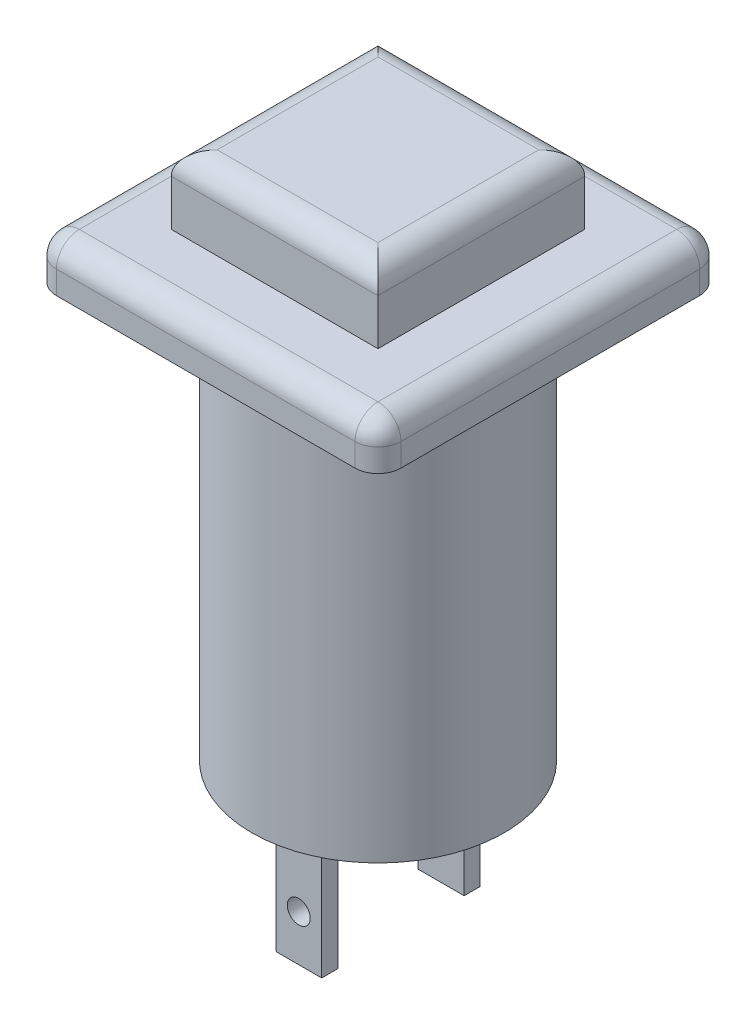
ISO-10303-21;
HEADER;
FILE_DESCRIPTION(('STEP AP214'),'2;1');
FILE_NAME('part.step','',(''),(''),'','','');
FILE_SCHEMA(('AUTOMOTIVE_DESIGN { 1 0 10303 214 1 1 1 1 }'));
ENDSEC;
DATA;
#1=APPLICATION_CONTEXT('core data for automotive mechanical design processes');
#2=APPLICATION_PROTOCOL_DEFINITION('international standard','automotive_design',2000,#1);
#3=PRODUCT_CONTEXT('',#1,'mechanical');
#4=PRODUCT('Part','Part','',(#3));
#5=PRODUCT_RELATED_PRODUCT_CATEGORY('part','',(#4));
#6=PRODUCT_DEFINITION_FORMATION('','',#4);
#7=PRODUCT_DEFINITION_CONTEXT('part definition',#1,'design');
#8=PRODUCT_DEFINITION('design','',#6,#7);
#9=PRODUCT_DEFINITION_SHAPE('','',#8);
#10=(LENGTH_UNIT() NAMED_UNIT(*) SI_UNIT(.MILLI.,.METRE.));
#11=(NAMED_UNIT(*) PLANE_ANGLE_UNIT() SI_UNIT($,.RADIAN.));
#12=(NAMED_UNIT(*) SI_UNIT($,.STERADIAN.) SOLID_ANGLE_UNIT());
#13=UNCERTAINTY_MEASURE_WITH_UNIT(LENGTH_MEASURE(1.E-05),#10,'distance_accuracy_value','');
#14=(GEOMETRIC_REPRESENTATION_CONTEXT(3) GLOBAL_UNCERTAINTY_ASSIGNED_CONTEXT((#13)) GLOBAL_UNIT_ASSIGNED_CONTEXT((#10,
#11,#12)) REPRESENTATION_CONTEXT('',''));
#15=CARTESIAN_POINT('',(0.,0.,0.));
#16=DIRECTION('',(0.,0.,1.));
#17=DIRECTION('',(1.,0.,0.));
#18=AXIS2_PLACEMENT_3D('',#15,#16,#17);
#19=CARTESIAN_POINT('',(-24.6836870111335,-42.0590909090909,0.));
#20=DIRECTION('',(0.,-1.,0.));
#21=DIRECTION('',(0.,0.,-1.));
#22=AXIS2_PLACEMENT_3D('',#19,#20,#21);
#23=PLANE('',#22);
#24=DIRECTION('',(1.,0.,0.));
#25=VECTOR('',#24,1.);
#26=CARTESIAN_POINT('',(-20.1836870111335,-42.0590909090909,2.75));
#27=LINE('',#26,#25);
#28=CARTESIAN_POINT('',(-20.1836870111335,-42.0590909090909,2.75));
#29=VERTEX_POINT('',#28);
#30=CARTESIAN_POINT('',(-18.1836870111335,-42.0590909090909,2.75));
#31=VERTEX_POINT('',#30);
#32=EDGE_CURVE('E239',#29,#31,#27,.T.);
#33=ORIENTED_EDGE('',*,*,#32,.F.);
#34=DIRECTION('',(0.,0.,-1.));
#35=VECTOR('',#34,1.);
#36=CARTESIAN_POINT('',(-20.1836870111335,-42.0590909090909,3.45));
#37=LINE('',#36,#35);
#38=CARTESIAN_POINT('',(-20.1836870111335,-42.0590909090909,3.45));
#39=VERTEX_POINT('',#38);
#40=EDGE_CURVE('E206',#39,#29,#37,.T.);
#41=ORIENTED_EDGE('',*,*,#40,.F.);
#42=DIRECTION('',(-1.,0.,0.));
#43=VECTOR('',#42,1.);
#44=CARTESIAN_POINT('',(-20.1836870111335,-42.0590909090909,3.45));
#45=LINE('',#44,#43);
#46=CARTESIAN_POINT('',(-18.1836870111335,-42.0590909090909,3.45));
#47=VERTEX_POINT('',#46);
#48=EDGE_CURVE('E243',#47,#39,#45,.T.);
#49=ORIENTED_EDGE('',*,*,#48,.F.);
#50=DIRECTION('',(0.,0.,1.));
#51=VECTOR('',#50,1.);
#52=CARTESIAN_POINT('',(-18.1836870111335,-42.0590909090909,3.45));
#53=LINE('',#52,#51);
#54=EDGE_CURVE('E241',#31,#47,#53,.T.);
#55=ORIENTED_EDGE('',*,*,#54,.F.);
#56=EDGE_LOOP('',(#33,#41,#49,#55));
#57=FACE_BOUND('',#56,.T.);
#58=CARTESIAN_POINT('',(-19.1836870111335,-42.0590909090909,0.));
#59=DIRECTION('',(0.,1.,0.));
#60=DIRECTION('',(0.,0.,1.));
#61=AXIS2_PLACEMENT_3D('',#58,#59,#60);
#62=CIRCLE('',#61,5.5);
#63=CARTESIAN_POINT('',(-19.1836870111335,-42.0590909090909,5.5));
#64=VERTEX_POINT('',#63);
#65=EDGE_CURVE('E323',#64,#64,#62,.T.);
#66=ORIENTED_EDGE('',*,*,#65,.F.);
#67=EDGE_LOOP('',(#66));
#68=FACE_BOUND('',#67,.T.);
#69=DIRECTION('',(1.,0.,0.));
#70=VECTOR('',#69,1.);
#71=CARTESIAN_POINT('',(-20.1836870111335,-42.0590909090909,-3.45));
#72=LINE('',#71,#70);
#73=CARTESIAN_POINT('',(-20.1836870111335,-42.0590909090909,-3.45));
#74=VERTEX_POINT('',#73);
#75=CARTESIAN_POINT('',(-18.1836870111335,-42.0590909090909,-3.45));
#76=VERTEX_POINT('',#75);
#77=EDGE_CURVE('E200',#74,#76,#72,.T.);
#78=ORIENTED_EDGE('',*,*,#77,.F.);
#79=DIRECTION('',(0.,0.,-1.));
#80=VECTOR('',#79,1.);
#81=CARTESIAN_POINT('',(-20.1836870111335,-42.0590909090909,-2.75));
#82=LINE('',#81,#80);
#83=CARTESIAN_POINT('',(-20.1836870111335,-42.0590909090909,-2.75));
#84=VERTEX_POINT('',#83);
#85=EDGE_CURVE('E211',#84,#74,#82,.T.);
#86=ORIENTED_EDGE('',*,*,#85,.F.);
#87=DIRECTION('',(-1.,0.,0.));
#88=VECTOR('',#87,1.);
#89=CARTESIAN_POINT('',(-20.1836870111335,-42.0590909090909,-2.75));
#90=LINE('',#89,#88);
#91=CARTESIAN_POINT('',(-18.1836870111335,-42.0590909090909,-2.75));
#92=VERTEX_POINT('',#91);
#93=EDGE_CURVE('E222',#92,#84,#90,.T.);
#94=ORIENTED_EDGE('',*,*,#93,.F.);
#95=DIRECTION('',(0.,0.,1.));
#96=VECTOR('',#95,1.);
#97=CARTESIAN_POINT('',(-18.1836870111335,-42.0590909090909,-2.75));
#98=LINE('',#97,#96);
#99=EDGE_CURVE('E220',#76,#92,#98,.T.);
#100=ORIENTED_EDGE('',*,*,#99,.F.);
#101=EDGE_LOOP('',(#78,#86,#94,#100));
#102=FACE_BOUND('',#101,.T.);
#103=ADVANCED_FACE('F33',(#57,#68,#102),#23,.T.);
#104=CARTESIAN_POINT('',(-26.1836870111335,-22.0590909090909,0.));
#105=DIRECTION('',(0.,1.,0.));
#106=DIRECTION('',(0.,0.,1.));
#107=AXIS2_PLACEMENT_3D('',#104,#105,#106);
#108=PLANE('',#107);
#109=DIRECTION('',(-1.,0.,0.));
#110=VECTOR('',#109,1.);
#111=CARTESIAN_POINT('',(-26.1836870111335,-22.0590909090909,-6.5));
#112=LINE('',#111,#110);
#113=CARTESIAN_POINT('',(-12.6836870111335,-22.0590909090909,-6.5));
#114=VERTEX_POINT('',#113);
#115=CARTESIAN_POINT('',(-25.6836870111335,-22.0590909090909,-6.5));
#116=VERTEX_POINT('',#115);
#117=EDGE_CURVE('E398',#114,#116,#112,.T.);
#118=ORIENTED_EDGE('',*,*,#117,.T.);
#119=DIRECTION('',(0.,0.,1.));
#120=VECTOR('',#119,1.);
#121=CARTESIAN_POINT('',(-25.6836870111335,-22.0590909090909,0.));
#122=LINE('',#121,#120);
#123=CARTESIAN_POINT('',(-25.6836870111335,-22.0590909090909,6.5));
#124=VERTEX_POINT('',#123);
#125=EDGE_CURVE('E400',#116,#124,#122,.T.);
#126=ORIENTED_EDGE('',*,*,#125,.T.);
#127=DIRECTION('',(1.,0.,0.));
#128=VECTOR('',#127,1.);
#129=CARTESIAN_POINT('',(-26.1836870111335,-22.0590909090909,6.5));
#130=LINE('',#129,#128);
#131=CARTESIAN_POINT('',(-12.6836870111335,-22.0590909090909,6.5));
#132=VERTEX_POINT('',#131);
#133=EDGE_CURVE('E394',#124,#132,#130,.T.);
#134=ORIENTED_EDGE('',*,*,#133,.T.);
#135=DIRECTION('',(0.,0.,-1.));
#136=VECTOR('',#135,1.);
#137=CARTESIAN_POINT('',(-12.6836870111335,-22.0590909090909,0.));
#138=LINE('',#137,#136);
#139=EDGE_CURVE('E396',#132,#114,#138,.T.);
#140=ORIENTED_EDGE('',*,*,#139,.T.);
#141=EDGE_LOOP('',(#118,#126,#134,#140));
#142=FACE_BOUND('',#141,.T.);
#143=DIRECTION('',(1.,0.,0.));
#144=VECTOR('',#143,1.);
#145=CARTESIAN_POINT('',(-14.6836870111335,-22.0590909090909,4.5));
#146=LINE('',#145,#144);
#147=CARTESIAN_POINT('',(-23.6836870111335,-22.0590909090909,4.5));
#148=VERTEX_POINT('',#147);
#149=CARTESIAN_POINT('',(-14.6836870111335,-22.0590909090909,4.5));
#150=VERTEX_POINT('',#149);
#151=EDGE_CURVE('E316',#148,#150,#146,.T.);
#152=ORIENTED_EDGE('',*,*,#151,.F.);
#153=DIRECTION('',(0.,0.,1.));
#154=VECTOR('',#153,1.);
#155=CARTESIAN_POINT('',(-23.6836870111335,-22.0590909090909,4.5));
#156=LINE('',#155,#154);
#157=CARTESIAN_POINT('',(-23.6836870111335,-22.0590909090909,-4.5));
#158=VERTEX_POINT('',#157);
#159=EDGE_CURVE('E313',#158,#148,#156,.T.);
#160=ORIENTED_EDGE('',*,*,#159,.F.);
#161=DIRECTION('',(-1.,0.,0.));
#162=VECTOR('',#161,1.);
#163=CARTESIAN_POINT('',(-14.6836870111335,-22.0590909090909,-4.5));
#164=LINE('',#163,#162);
#165=CARTESIAN_POINT('',(-14.6836870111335,-22.0590909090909,-4.5));
#166=VERTEX_POINT('',#165);
#167=EDGE_CURVE('E310',#166,#158,#164,.T.);
#168=ORIENTED_EDGE('',*,*,#167,.F.);
#169=DIRECTION('',(0.,0.,-1.));
#170=VECTOR('',#169,1.);
#171=CARTESIAN_POINT('',(-14.6836870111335,-22.0590909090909,4.5));
#172=LINE('',#171,#170);
#173=EDGE_CURVE('E307',#150,#166,#172,.T.);
#174=ORIENTED_EDGE('',*,*,#173,.F.);
#175=EDGE_LOOP('',(#152,#160,#168,#174));
#176=FACE_BOUND('',#175,.T.);
#177=ADVANCED_FACE('F428',(#142,#176),#108,.T.);
#178=CARTESIAN_POINT('',(-14.6836870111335,-22.0590909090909,4.5));
#179=DIRECTION('',(1.,0.,0.));
#180=DIRECTION('',(0.,0.,-1.));
#181=AXIS2_PLACEMENT_3D('',#178,#179,#180);
#182=PLANE('',#181);
#183=DIRECTION('',(0.,1.,0.));
#184=VECTOR('',#183,1.);
#185=CARTESIAN_POINT('',(-14.6836870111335,-22.0590909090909,-4.5));
#186=LINE('',#185,#184);
#187=CARTESIAN_POINT('',(-14.6836870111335,-20.0590909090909,-4.5));
#188=VERTEX_POINT('',#187);
#189=EDGE_CURVE('E319',#166,#188,#186,.T.);
#190=ORIENTED_EDGE('',*,*,#189,.T.);
#191=DIRECTION('',(0.,0.,-1.));
#192=VECTOR('',#191,1.);
#193=CARTESIAN_POINT('',(-14.6836870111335,-20.0590909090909,4.5));
#194=LINE('',#193,#192);
#195=CARTESIAN_POINT('',(-14.6836870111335,-20.0590909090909,4.5));
#196=VERTEX_POINT('',#195);
#197=EDGE_CURVE('E351',#188,#196,#194,.F.);
#198=ORIENTED_EDGE('',*,*,#197,.T.);
#199=DIRECTION('',(0.,1.,0.));
#200=VECTOR('',#199,1.);
#201=CARTESIAN_POINT('',(-14.6836870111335,-22.0590909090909,4.5));
#202=LINE('',#201,#200);
#203=EDGE_CURVE('E320',#150,#196,#202,.T.);
#204=ORIENTED_EDGE('',*,*,#203,.F.);
#205=ORIENTED_EDGE('',*,*,#173,.T.);
#206=EDGE_LOOP('',(#190,#198,#204,#205));
#207=FACE_BOUND('',#206,.T.);
#208=ADVANCED_FACE('F490',(#207),#182,.T.);
#209=CARTESIAN_POINT('',(-14.6836870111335,-22.0590909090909,4.5));
#210=DIRECTION('',(0.,0.,1.));
#211=DIRECTION('',(1.,0.,0.));
#212=AXIS2_PLACEMENT_3D('',#209,#210,#211);
#213=PLANE('',#212);
#214=ORIENTED_EDGE('',*,*,#203,.T.);
#215=DIRECTION('',(1.,0.,0.));
#216=VECTOR('',#215,1.);
#217=CARTESIAN_POINT('',(-14.6836870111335,-20.0590909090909,4.5));
#218=LINE('',#217,#216);
#219=CARTESIAN_POINT('',(-23.6836870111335,-20.0590909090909,4.5));
#220=VERTEX_POINT('',#219);
#221=EDGE_CURVE('E353',#196,#220,#218,.F.);
#222=ORIENTED_EDGE('',*,*,#221,.T.);
#223=DIRECTION('',(0.,1.,0.));
#224=VECTOR('',#223,1.);
#225=CARTESIAN_POINT('',(-23.6836870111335,-22.0590909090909,4.5));
#226=LINE('',#225,#224);
#227=EDGE_CURVE('E324',#148,#220,#226,.T.);
#228=ORIENTED_EDGE('',*,*,#227,.F.);
#229=ORIENTED_EDGE('',*,*,#151,.T.);
#230=EDGE_LOOP('',(#214,#222,#228,#229));
#231=FACE_BOUND('',#230,.T.);
#232=ADVANCED_FACE('F538',(#231),#213,.T.);
#233=CARTESIAN_POINT('',(-23.6836870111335,-22.0590909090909,4.5));
#234=DIRECTION('',(-1.,0.,0.));
#235=DIRECTION('',(0.,-1.,0.));
#236=AXIS2_PLACEMENT_3D('',#233,#234,#235);
#237=PLANE('',#236);
#238=ORIENTED_EDGE('',*,*,#227,.T.);
#239=DIRECTION('',(0.,0.,1.));
#240=VECTOR('',#239,1.);
#241=CARTESIAN_POINT('',(-23.6836870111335,-20.0590909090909,4.5));
#242=LINE('',#241,#240);
#243=CARTESIAN_POINT('',(-23.6836870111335,-20.0590909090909,-4.5));
#244=VERTEX_POINT('',#243);
#245=EDGE_CURVE('E346',#220,#244,#242,.F.);
#246=ORIENTED_EDGE('',*,*,#245,.T.);
#247=DIRECTION('',(0.,1.,0.));
#248=VECTOR('',#247,1.);
#249=CARTESIAN_POINT('',(-23.6836870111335,-22.0590909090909,-4.5));
#250=LINE('',#249,#248);
#251=EDGE_CURVE('E327',#158,#244,#250,.T.);
#252=ORIENTED_EDGE('',*,*,#251,.F.);
#253=ORIENTED_EDGE('',*,*,#159,.T.);
#254=EDGE_LOOP('',(#238,#246,#252,#253));
#255=FACE_BOUND('',#254,.T.);
#256=ADVANCED_FACE('F541',(#255),#237,.T.);
#257=CARTESIAN_POINT('',(-14.6836870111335,-22.0590909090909,-4.5));
#258=DIRECTION('',(0.,0.,-1.));
#259=DIRECTION('',(-1.,0.,0.));
#260=AXIS2_PLACEMENT_3D('',#257,#258,#259);
#261=PLANE('',#260);
#262=ORIENTED_EDGE('',*,*,#251,.T.);
#263=DIRECTION('',(-1.,0.,0.));
#264=VECTOR('',#263,1.);
#265=CARTESIAN_POINT('',(-14.6836870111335,-20.0590909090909,-4.5));
#266=LINE('',#265,#264);
#267=EDGE_CURVE('E349',#244,#188,#266,.F.);
#268=ORIENTED_EDGE('',*,*,#267,.T.);
#269=ORIENTED_EDGE('',*,*,#189,.F.);
#270=ORIENTED_EDGE('',*,*,#167,.T.);
#271=EDGE_LOOP('',(#262,#268,#269,#270));
#272=FACE_BOUND('',#271,.T.);
#273=ADVANCED_FACE('F544',(#272),#261,.T.);
#274=CARTESIAN_POINT('',(-19.1836870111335,-19.0590909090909,0.));
#275=DIRECTION('',(0.,1.,0.));
#276=DIRECTION('',(0.,0.,1.));
#277=AXIS2_PLACEMENT_3D('',#274,#275,#276);
#278=PLANE('',#277);
#279=DIRECTION('',(-1.,0.,0.));
#280=VECTOR('',#279,1.);
#281=CARTESIAN_POINT('',(-19.1836870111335,-19.0590909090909,-3.5));
#282=LINE('',#281,#280);
#283=CARTESIAN_POINT('',(-15.6836870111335,-19.0590909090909,-3.5));
#284=VERTEX_POINT('',#283);
#285=CARTESIAN_POINT('',(-22.6836870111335,-19.0590909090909,-3.5));
#286=VERTEX_POINT('',#285);
#287=EDGE_CURVE('E341',#284,#286,#282,.T.);
#288=ORIENTED_EDGE('',*,*,#287,.T.);
#289=DIRECTION('',(0.,0.,1.));
#290=VECTOR('',#289,1.);
#291=CARTESIAN_POINT('',(-22.6836870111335,-19.0590909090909,0.));
#292=LINE('',#291,#290);
#293=CARTESIAN_POINT('',(-22.6836870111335,-19.0590909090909,3.5));
#294=VERTEX_POINT('',#293);
#295=EDGE_CURVE('E343',#286,#294,#292,.T.);
#296=ORIENTED_EDGE('',*,*,#295,.T.);
#297=DIRECTION('',(1.,0.,0.));
#298=VECTOR('',#297,1.);
#299=CARTESIAN_POINT('',(-19.1836870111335,-19.0590909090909,3.5));
#300=LINE('',#299,#298);
#301=CARTESIAN_POINT('',(-15.6836870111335,-19.0590909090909,3.5));
#302=VERTEX_POINT('',#301);
#303=EDGE_CURVE('E337',#294,#302,#300,.T.);
#304=ORIENTED_EDGE('',*,*,#303,.T.);
#305=DIRECTION('',(0.,0.,-1.));
#306=VECTOR('',#305,1.);
#307=CARTESIAN_POINT('',(-15.6836870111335,-19.0590909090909,0.));
#308=LINE('',#307,#306);
#309=EDGE_CURVE('E339',#302,#284,#308,.T.);
#310=ORIENTED_EDGE('',*,*,#309,.T.);
#311=EDGE_LOOP('',(#288,#296,#304,#310));
#312=FACE_BOUND('',#311,.T.);
#313=ADVANCED_FACE('F35',(#312),#278,.T.);
#314=CARTESIAN_POINT('',(-15.6836870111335,-20.0590909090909,0.));
#315=DIRECTION('',(0.,0.,-1.));
#316=DIRECTION('',(-1.,0.,0.));
#317=AXIS2_PLACEMENT_3D('',#314,#315,#316);
#318=CYLINDRICAL_SURFACE('',#317,1.);
#319=CARTESIAN_POINT('',(-15.6836870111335,-20.0590909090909,3.5));
#320=DIRECTION('',(0.707106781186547,0.,-0.707106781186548));
#321=DIRECTION('',(0.707106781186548,0.,0.707106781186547));
#322=AXIS2_PLACEMENT_3D('',#319,#320,#321);
#323=ELLIPSE('',#322,1.4142135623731,1.);
#324=EDGE_CURVE('E301',#196,#302,#323,.F.);
#325=ORIENTED_EDGE('',*,*,#324,.F.);
#326=ORIENTED_EDGE('',*,*,#197,.F.);
#327=CARTESIAN_POINT('',(-15.6836870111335,-20.0590909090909,-3.5));
#328=DIRECTION('',(-0.707106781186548,0.,-0.707106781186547));
#329=DIRECTION('',(0.707106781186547,0.,-0.707106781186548));
#330=AXIS2_PLACEMENT_3D('',#327,#328,#329);
#331=ELLIPSE('',#330,1.41421356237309,1.);
#332=EDGE_CURVE('E304',#284,#188,#331,.T.);
#333=ORIENTED_EDGE('',*,*,#332,.F.);
#334=ORIENTED_EDGE('',*,*,#309,.F.);
#335=EDGE_LOOP('',(#325,#326,#333,#334));
#336=FACE_BOUND('',#335,.T.);
#337=ADVANCED_FACE('F533',(#336),#318,.T.);
#338=CARTESIAN_POINT('',(-19.1836870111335,-20.0590909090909,-3.5));
#339=DIRECTION('',(-1.,0.,0.));
#340=DIRECTION('',(0.,0.,1.));
#341=AXIS2_PLACEMENT_3D('',#338,#339,#340);
#342=CYLINDRICAL_SURFACE('',#341,1.);
#343=ORIENTED_EDGE('',*,*,#332,.T.);
#344=ORIENTED_EDGE('',*,*,#267,.F.);
#345=CARTESIAN_POINT('',(-22.6836870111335,-20.0590909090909,-3.5));
#346=DIRECTION('',(-0.707106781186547,0.,0.707106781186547));
#347=DIRECTION('',(-0.707106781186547,0.,-0.707106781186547));
#348=AXIS2_PLACEMENT_3D('',#345,#346,#347);
#349=ELLIPSE('',#348,1.41421356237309,1.);
#350=EDGE_CURVE('E299',#286,#244,#349,.T.);
#351=ORIENTED_EDGE('',*,*,#350,.F.);
#352=ORIENTED_EDGE('',*,*,#287,.F.);
#353=EDGE_LOOP('',(#343,#344,#351,#352));
#354=FACE_BOUND('',#353,.T.);
#355=ADVANCED_FACE('F529',(#354),#342,.T.);
#356=CARTESIAN_POINT('',(-19.1836870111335,-20.0590909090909,3.5));
#357=DIRECTION('',(1.,0.,0.));
#358=DIRECTION('',(0.,0.,-1.));
#359=AXIS2_PLACEMENT_3D('',#356,#357,#358);
#360=CYLINDRICAL_SURFACE('',#359,1.);
#361=ORIENTED_EDGE('',*,*,#324,.T.);
#362=ORIENTED_EDGE('',*,*,#303,.F.);
#363=CARTESIAN_POINT('',(-22.6836870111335,-20.0590909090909,3.5));
#364=DIRECTION('',(0.707106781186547,0.,0.707106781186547));
#365=DIRECTION('',(0.707106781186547,0.,-0.707106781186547));
#366=AXIS2_PLACEMENT_3D('',#363,#364,#365);
#367=ELLIPSE('',#366,1.41421356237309,1.);
#368=EDGE_CURVE('E297',#220,#294,#367,.F.);
#369=ORIENTED_EDGE('',*,*,#368,.F.);
#370=ORIENTED_EDGE('',*,*,#221,.F.);
#371=EDGE_LOOP('',(#361,#362,#369,#370));
#372=FACE_BOUND('',#371,.T.);
#373=ADVANCED_FACE('F525',(#372),#360,.T.);
#374=CARTESIAN_POINT('',(-22.6836870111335,-20.0590909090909,0.));
#375=DIRECTION('',(0.,0.,1.));
#376=DIRECTION('',(1.,0.,0.));
#377=AXIS2_PLACEMENT_3D('',#374,#375,#376);
#378=CYLINDRICAL_SURFACE('',#377,1.);
#379=ORIENTED_EDGE('',*,*,#350,.T.);
#380=ORIENTED_EDGE('',*,*,#245,.F.);
#381=ORIENTED_EDGE('',*,*,#368,.T.);
#382=ORIENTED_EDGE('',*,*,#295,.F.);
#383=EDGE_LOOP('',(#379,#380,#381,#382));
#384=FACE_BOUND('',#383,.T.);
#385=ADVANCED_FACE('F522',(#384),#378,.T.);
#386=CARTESIAN_POINT('',(-11.6836870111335,-32.0590909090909,7.5));
#387=DIRECTION('',(1.,0.,0.));
#388=DIRECTION('',(0.,1.,0.));
#389=AXIS2_PLACEMENT_3D('',#386,#387,#388);
#390=PLANE('',#389);
#391=DIRECTION('',(0.,0.,1.));
#392=VECTOR('',#391,1.);
#393=CARTESIAN_POINT('',(-11.6836870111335,-24.0590909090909,0.));
#394=LINE('',#393,#392);
#395=CARTESIAN_POINT('',(-11.6836870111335,-24.0590909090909,-6.5));
#396=VERTEX_POINT('',#395);
#397=CARTESIAN_POINT('',(-11.6836870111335,-24.0590909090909,6.5));
#398=VERTEX_POINT('',#397);
#399=EDGE_CURVE('E364',#396,#398,#394,.T.);
#400=ORIENTED_EDGE('',*,*,#399,.F.);
#401=DIRECTION('',(0.,1.,0.));
#402=VECTOR('',#401,1.);
#403=CARTESIAN_POINT('',(-11.6836870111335,-32.0590909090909,-6.5));
#404=LINE('',#403,#402);
#405=CARTESIAN_POINT('',(-11.6836870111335,-23.0590909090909,-6.5));
#406=VERTEX_POINT('',#405);
#407=EDGE_CURVE('E11',#396,#406,#404,.T.);
#408=ORIENTED_EDGE('',*,*,#407,.T.);
#409=DIRECTION('',(0.,0.,-1.));
#410=VECTOR('',#409,1.);
#411=CARTESIAN_POINT('',(-11.6836870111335,-23.0590909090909,7.5));
#412=LINE('',#411,#410);
#413=CARTESIAN_POINT('',(-11.6836870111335,-23.0590909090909,6.5));
#414=VERTEX_POINT('',#413);
#415=EDGE_CURVE('E42',#406,#414,#412,.F.);
#416=ORIENTED_EDGE('',*,*,#415,.T.);
#417=DIRECTION('',(0.,1.,0.));
#418=VECTOR('',#417,1.);
#419=CARTESIAN_POINT('',(-11.6836870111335,-32.0590909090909,6.5));
#420=LINE('',#419,#418);
#421=EDGE_CURVE('E403',#414,#398,#420,.F.);
#422=ORIENTED_EDGE('',*,*,#421,.T.);
#423=EDGE_LOOP('',(#400,#408,#416,#422));
#424=FACE_BOUND('',#423,.T.);
#425=ADVANCED_FACE('F409',(#424),#390,.T.);
#426=CARTESIAN_POINT('',(-11.6836870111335,-32.0590909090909,7.5));
#427=DIRECTION('',(0.,0.,1.));
#428=DIRECTION('',(1.,0.,0.));
#429=AXIS2_PLACEMENT_3D('',#426,#427,#428);
#430=PLANE('',#429);
#431=DIRECTION('',(1.,0.,0.));
#432=VECTOR('',#431,1.);
#433=CARTESIAN_POINT('',(-11.6836870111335,-23.0590909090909,7.5));
#434=LINE('',#433,#432);
#435=CARTESIAN_POINT('',(-12.6836870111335,-23.0590909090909,7.5));
#436=VERTEX_POINT('',#435);
#437=CARTESIAN_POINT('',(-25.6836870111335,-23.0590909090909,7.5));
#438=VERTEX_POINT('',#437);
#439=EDGE_CURVE('E388',#436,#438,#434,.F.);
#440=ORIENTED_EDGE('',*,*,#439,.T.);
#441=DIRECTION('',(0.,1.,0.));
#442=VECTOR('',#441,1.);
#443=CARTESIAN_POINT('',(-25.6836870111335,-32.0590909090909,7.5));
#444=LINE('',#443,#442);
#445=CARTESIAN_POINT('',(-25.6836870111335,-24.0590909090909,7.5));
#446=VERTEX_POINT('',#445);
#447=EDGE_CURVE('E392',#438,#446,#444,.F.);
#448=ORIENTED_EDGE('',*,*,#447,.T.);
#449=DIRECTION('',(-1.,0.,0.));
#450=VECTOR('',#449,1.);
#451=CARTESIAN_POINT('',(-31.1836870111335,-24.0590909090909,7.5));
#452=LINE('',#451,#450);
#453=CARTESIAN_POINT('',(-12.6836870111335,-24.0590909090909,7.5));
#454=VERTEX_POINT('',#453);
#455=EDGE_CURVE('E361',#454,#446,#452,.T.);
#456=ORIENTED_EDGE('',*,*,#455,.F.);
#457=DIRECTION('',(0.,1.,0.));
#458=VECTOR('',#457,1.);
#459=CARTESIAN_POINT('',(-12.6836870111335,-32.0590909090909,7.5));
#460=LINE('',#459,#458);
#461=EDGE_CURVE('E390',#454,#436,#460,.T.);
#462=ORIENTED_EDGE('',*,*,#461,.T.);
#463=EDGE_LOOP('',(#440,#448,#456,#462));
#464=FACE_BOUND('',#463,.T.);
#465=ADVANCED_FACE('F438',(#464),#430,.T.);
#466=CARTESIAN_POINT('',(-26.6836870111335,-32.0590909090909,7.5));
#467=DIRECTION('',(-1.,0.,0.));
#468=DIRECTION('',(0.,-1.,0.));
#469=AXIS2_PLACEMENT_3D('',#466,#467,#468);
#470=PLANE('',#469);
#471=DIRECTION('',(0.,0.,1.));
#472=VECTOR('',#471,1.);
#473=CARTESIAN_POINT('',(-26.6836870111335,-23.0590909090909,7.5));
#474=LINE('',#473,#472);
#475=CARTESIAN_POINT('',(-26.6836870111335,-23.0590909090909,6.5));
#476=VERTEX_POINT('',#475);
#477=CARTESIAN_POINT('',(-26.6836870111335,-23.0590909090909,-6.5));
#478=VERTEX_POINT('',#477);
#479=EDGE_CURVE('E374',#476,#478,#474,.F.);
#480=ORIENTED_EDGE('',*,*,#479,.T.);
#481=DIRECTION('',(0.,1.,0.));
#482=VECTOR('',#481,1.);
#483=CARTESIAN_POINT('',(-26.6836870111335,-32.0590909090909,-6.5));
#484=LINE('',#483,#482);
#485=CARTESIAN_POINT('',(-26.6836870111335,-24.0590909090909,-6.5));
#486=VERTEX_POINT('',#485);
#487=EDGE_CURVE('E378',#478,#486,#484,.F.);
#488=ORIENTED_EDGE('',*,*,#487,.T.);
#489=DIRECTION('',(0.,0.,-1.));
#490=VECTOR('',#489,1.);
#491=CARTESIAN_POINT('',(-26.6836870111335,-24.0590909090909,0.));
#492=LINE('',#491,#490);
#493=CARTESIAN_POINT('',(-26.6836870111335,-24.0590909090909,6.5));
#494=VERTEX_POINT('',#493);
#495=EDGE_CURVE('E358',#494,#486,#492,.T.);
#496=ORIENTED_EDGE('',*,*,#495,.F.);
#497=DIRECTION('',(0.,1.,0.));
#498=VECTOR('',#497,1.);
#499=CARTESIAN_POINT('',(-26.6836870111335,-32.0590909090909,6.5));
#500=LINE('',#499,#498);
#501=EDGE_CURVE('E376',#494,#476,#500,.T.);
#502=ORIENTED_EDGE('',*,*,#501,.T.);
#503=EDGE_LOOP('',(#480,#488,#496,#502));
#504=FACE_BOUND('',#503,.T.);
#505=ADVANCED_FACE('F451',(#504),#470,.T.);
#506=CARTESIAN_POINT('',(-11.6836870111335,-32.0590909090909,-7.5));
#507=DIRECTION('',(0.,0.,-1.));
#508=DIRECTION('',(-1.,0.,0.));
#509=AXIS2_PLACEMENT_3D('',#506,#507,#508);
#510=PLANE('',#509);
#511=DIRECTION('',(1.,0.,0.));
#512=VECTOR('',#511,1.);
#513=CARTESIAN_POINT('',(-31.1836870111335,-24.0590909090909,-7.5));
#514=LINE('',#513,#512);
#515=CARTESIAN_POINT('',(-25.6836870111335,-24.0590909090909,-7.5));
#516=VERTEX_POINT('',#515);
#517=CARTESIAN_POINT('',(-12.6836870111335,-24.0590909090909,-7.5));
#518=VERTEX_POINT('',#517);
#519=EDGE_CURVE('E355',#516,#518,#514,.T.);
#520=ORIENTED_EDGE('',*,*,#519,.F.);
#521=DIRECTION('',(0.,1.,0.));
#522=VECTOR('',#521,1.);
#523=CARTESIAN_POINT('',(-25.6836870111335,-32.0590909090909,-7.5));
#524=LINE('',#523,#522);
#525=CARTESIAN_POINT('',(-25.6836870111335,-23.0590909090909,-7.5));
#526=VERTEX_POINT('',#525);
#527=EDGE_CURVE('E371',#516,#526,#524,.T.);
#528=ORIENTED_EDGE('',*,*,#527,.T.);
#529=DIRECTION('',(-1.,0.,0.));
#530=VECTOR('',#529,1.);
#531=CARTESIAN_POINT('',(-11.6836870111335,-23.0590909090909,-7.5));
#532=LINE('',#531,#530);
#533=CARTESIAN_POINT('',(-12.6836870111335,-23.0590909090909,-7.5));
#534=VERTEX_POINT('',#533);
#535=EDGE_CURVE('E369',#526,#534,#532,.F.);
#536=ORIENTED_EDGE('',*,*,#535,.T.);
#537=DIRECTION('',(0.,1.,0.));
#538=VECTOR('',#537,1.);
#539=CARTESIAN_POINT('',(-12.6836870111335,-32.0590909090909,-7.5));
#540=LINE('',#539,#538);
#541=EDGE_CURVE('E367',#534,#518,#540,.F.);
#542=ORIENTED_EDGE('',*,*,#541,.T.);
#543=EDGE_LOOP('',(#520,#528,#536,#542));
#544=FACE_BOUND('',#543,.T.);
#545=ADVANCED_FACE('F468',(#544),#510,.T.);
#546=CARTESIAN_POINT('',(-19.1836870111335,-19.0286481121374,0.));
#547=DIRECTION('',(0.,1.,0.));
#548=DIRECTION('',(0.,0.,1.));
#549=AXIS2_PLACEMENT_3D('',#546,#547,#548);
#550=CYLINDRICAL_SURFACE('',#549,5.5);
#551=ORIENTED_EDGE('',*,*,#65,.T.);
#552=EDGE_LOOP('',(#551));
#553=FACE_BOUND('',#552,.T.);
#554=CARTESIAN_POINT('',(-19.1836870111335,-24.0590909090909,0.));
#555=DIRECTION('',(0.,1.,0.));
#556=DIRECTION('',(0.,0.,1.));
#557=AXIS2_PLACEMENT_3D('',#554,#555,#556);
#558=CIRCLE('',#557,5.50000000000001);
#559=CARTESIAN_POINT('',(-19.1836870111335,-24.0590909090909,5.50000000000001));
#560=VERTEX_POINT('',#559);
#561=EDGE_CURVE('E334',#560,#560,#558,.T.);
#562=ORIENTED_EDGE('',*,*,#561,.F.);
#563=EDGE_LOOP('',(#562));
#564=FACE_BOUND('',#563,.T.);
#565=ADVANCED_FACE('F496',(#553,#564),#550,.T.);
#566=CARTESIAN_POINT('',(-31.1836870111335,-24.0590909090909,0.));
#567=DIRECTION('',(0.,-1.,0.));
#568=DIRECTION('',(0.,0.,-1.));
#569=AXIS2_PLACEMENT_3D('',#566,#567,#568);
#570=PLANE('',#569);
#571=ORIENTED_EDGE('',*,*,#561,.T.);
#572=EDGE_LOOP('',(#571));
#573=FACE_BOUND('',#572,.T.);
#574=ORIENTED_EDGE('',*,*,#495,.T.);
#575=CARTESIAN_POINT('',(-25.6836870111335,-24.0590909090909,-6.5));
#576=DIRECTION('',(0.,-1.,0.));
#577=DIRECTION('',(0.,0.,-1.));
#578=AXIS2_PLACEMENT_3D('',#575,#576,#577);
#579=CIRCLE('',#578,1.);
#580=EDGE_CURVE('E386',#486,#516,#579,.T.);
#581=ORIENTED_EDGE('',*,*,#580,.T.);
#582=ORIENTED_EDGE('',*,*,#519,.T.);
#583=CARTESIAN_POINT('',(-12.6836870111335,-24.0590909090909,-6.5));
#584=DIRECTION('',(0.,-1.,0.));
#585=DIRECTION('',(0.,0.,-1.));
#586=AXIS2_PLACEMENT_3D('',#583,#584,#585);
#587=CIRCLE('',#586,1.);
#588=EDGE_CURVE('E382',#518,#396,#587,.T.);
#589=ORIENTED_EDGE('',*,*,#588,.T.);
#590=ORIENTED_EDGE('',*,*,#399,.T.);
#591=CARTESIAN_POINT('',(-12.6836870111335,-24.0590909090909,6.5));
#592=DIRECTION('',(0.,-1.,0.));
#593=DIRECTION('',(0.,0.,-1.));
#594=AXIS2_PLACEMENT_3D('',#591,#592,#593);
#595=CIRCLE('',#594,1.);
#596=EDGE_CURVE('E380',#398,#454,#595,.T.);
#597=ORIENTED_EDGE('',*,*,#596,.T.);
#598=ORIENTED_EDGE('',*,*,#455,.T.);
#599=CARTESIAN_POINT('',(-25.6836870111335,-24.0590909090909,6.5));
#600=DIRECTION('',(0.,-1.,0.));
#601=DIRECTION('',(0.,0.,-1.));
#602=AXIS2_PLACEMENT_3D('',#599,#600,#601);
#603=CIRCLE('',#602,1.);
#604=EDGE_CURVE('E384',#446,#494,#603,.T.);
#605=ORIENTED_EDGE('',*,*,#604,.T.);
#606=EDGE_LOOP('',(#574,#581,#582,#589,#590,#597,#598,#605));
#607=FACE_BOUND('',#606,.T.);
#608=ADVANCED_FACE('F448',(#573,#607),#570,.T.);
#609=CARTESIAN_POINT('',(-12.6836870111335,-32.0590909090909,6.5));
#610=DIRECTION('',(0.,1.,0.));
#611=DIRECTION('',(-1.,0.,0.));
#612=AXIS2_PLACEMENT_3D('',#609,#610,#611);
#613=CYLINDRICAL_SURFACE('',#612,1.);
#614=CARTESIAN_POINT('',(-12.6836870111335,-23.0590909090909,6.5));
#615=DIRECTION('',(0.,1.,0.));
#616=DIRECTION('',(0.,0.,1.));
#617=AXIS2_PLACEMENT_3D('',#614,#615,#616);
#618=CIRCLE('',#617,1.);
#619=EDGE_CURVE('E294',#436,#414,#618,.T.);
#620=ORIENTED_EDGE('',*,*,#619,.F.);
#621=ORIENTED_EDGE('',*,*,#461,.F.);
#622=ORIENTED_EDGE('',*,*,#596,.F.);
#623=ORIENTED_EDGE('',*,*,#421,.F.);
#624=EDGE_LOOP('',(#620,#621,#622,#623));
#625=FACE_BOUND('',#624,.T.);
#626=ADVANCED_FACE('F417',(#625),#613,.T.);
#627=CARTESIAN_POINT('',(-12.6836870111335,-23.0590909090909,6.5));
#628=DIRECTION('',(0.,0.,1.));
#629=DIRECTION('',(1.,0.,0.));
#630=AXIS2_PLACEMENT_3D('',#627,#628,#629);
#631=SPHERICAL_SURFACE('',#630,1.);
#632=CARTESIAN_POINT('',(-12.6836870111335,-23.0590909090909,6.5));
#633=DIRECTION('',(1.,0.,0.));
#634=DIRECTION('',(0.,0.,-1.));
#635=AXIS2_PLACEMENT_3D('',#632,#633,#634);
#636=CIRCLE('',#635,1.);
#637=EDGE_CURVE('E288',#436,#132,#636,.F.);
#638=ORIENTED_EDGE('',*,*,#637,.F.);
#639=ORIENTED_EDGE('',*,*,#619,.T.);
#640=CARTESIAN_POINT('',(-12.6836870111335,-23.0590909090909,6.5));
#641=DIRECTION('',(0.,0.,1.));
#642=DIRECTION('',(1.,0.,0.));
#643=AXIS2_PLACEMENT_3D('',#640,#641,#642);
#644=CIRCLE('',#643,1.);
#645=EDGE_CURVE('E291',#132,#414,#644,.F.);
#646=ORIENTED_EDGE('',*,*,#645,.F.);
#647=EDGE_LOOP('',(#638,#639,#646));
#648=FACE_BOUND('',#647,.T.);
#649=ADVANCED_FACE('F422',(#648),#631,.T.);
#650=CARTESIAN_POINT('',(-12.6836870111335,-32.0590909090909,-6.5));
#651=DIRECTION('',(0.,1.,0.));
#652=DIRECTION('',(-1.,0.,0.));
#653=AXIS2_PLACEMENT_3D('',#650,#651,#652);
#654=CYLINDRICAL_SURFACE('',#653,1.);
#655=ORIENTED_EDGE('',*,*,#588,.F.);
#656=ORIENTED_EDGE('',*,*,#541,.F.);
#657=CARTESIAN_POINT('',(-12.6836870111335,-23.0590909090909,-6.5));
#658=DIRECTION('',(0.,1.,0.));
#659=DIRECTION('',(0.,0.,1.));
#660=AXIS2_PLACEMENT_3D('',#657,#658,#659);
#661=CIRCLE('',#660,1.);
#662=EDGE_CURVE('E285',#406,#534,#661,.T.);
#663=ORIENTED_EDGE('',*,*,#662,.F.);
#664=ORIENTED_EDGE('',*,*,#407,.F.);
#665=EDGE_LOOP('',(#655,#656,#663,#664));
#666=FACE_BOUND('',#665,.T.);
#667=ADVANCED_FACE('F471',(#666),#654,.T.);
#668=CARTESIAN_POINT('',(-12.6836870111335,-23.0590909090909,0.));
#669=DIRECTION('',(0.,0.,-1.));
#670=DIRECTION('',(-1.,0.,0.));
#671=AXIS2_PLACEMENT_3D('',#668,#669,#670);
#672=CYLINDRICAL_SURFACE('',#671,1.);
#673=ORIENTED_EDGE('',*,*,#645,.T.);
#674=ORIENTED_EDGE('',*,*,#415,.F.);
#675=CARTESIAN_POINT('',(-12.6836870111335,-23.0590909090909,-6.5));
#676=DIRECTION('',(0.,0.,-1.));
#677=DIRECTION('',(-1.,0.,0.));
#678=AXIS2_PLACEMENT_3D('',#675,#676,#677);
#679=CIRCLE('',#678,1.);
#680=EDGE_CURVE('E282',#114,#406,#679,.T.);
#681=ORIENTED_EDGE('',*,*,#680,.F.);
#682=ORIENTED_EDGE('',*,*,#139,.F.);
#683=EDGE_LOOP('',(#673,#674,#681,#682));
#684=FACE_BOUND('',#683,.T.);
#685=ADVANCED_FACE('F425',(#684),#672,.T.);
#686=CARTESIAN_POINT('',(-26.1836870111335,-23.0590909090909,6.5));
#687=DIRECTION('',(1.,0.,0.));
#688=DIRECTION('',(0.,0.,-1.));
#689=AXIS2_PLACEMENT_3D('',#686,#687,#688);
#690=CYLINDRICAL_SURFACE('',#689,1.);
#691=ORIENTED_EDGE('',*,*,#637,.T.);
#692=ORIENTED_EDGE('',*,*,#133,.F.);
#693=CARTESIAN_POINT('',(-25.6836870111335,-23.0590909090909,6.5));
#694=DIRECTION('',(-1.,0.,0.));
#695=DIRECTION('',(0.,0.,1.));
#696=AXIS2_PLACEMENT_3D('',#693,#694,#695);
#697=CIRCLE('',#696,1.);
#698=EDGE_CURVE('E279',#438,#124,#697,.T.);
#699=ORIENTED_EDGE('',*,*,#698,.F.);
#700=ORIENTED_EDGE('',*,*,#439,.F.);
#701=EDGE_LOOP('',(#691,#692,#699,#700));
#702=FACE_BOUND('',#701,.T.);
#703=ADVANCED_FACE('F435',(#702),#690,.T.);
#704=CARTESIAN_POINT('',(-25.6836870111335,-32.0590909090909,6.5));
#705=DIRECTION('',(0.,1.,0.));
#706=DIRECTION('',(-1.,0.,0.));
#707=AXIS2_PLACEMENT_3D('',#704,#705,#706);
#708=CYLINDRICAL_SURFACE('',#707,1.);
#709=ORIENTED_EDGE('',*,*,#604,.F.);
#710=ORIENTED_EDGE('',*,*,#447,.F.);
#711=CARTESIAN_POINT('',(-25.6836870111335,-23.0590909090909,6.5));
#712=DIRECTION('',(0.,1.,0.));
#713=DIRECTION('',(0.,0.,1.));
#714=AXIS2_PLACEMENT_3D('',#711,#712,#713);
#715=CIRCLE('',#714,1.);
#716=EDGE_CURVE('E276',#476,#438,#715,.T.);
#717=ORIENTED_EDGE('',*,*,#716,.F.);
#718=ORIENTED_EDGE('',*,*,#501,.F.);
#719=EDGE_LOOP('',(#709,#710,#717,#718));
#720=FACE_BOUND('',#719,.T.);
#721=ADVANCED_FACE('F443',(#720),#708,.T.);
#722=CARTESIAN_POINT('',(-12.6836870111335,-23.0590909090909,-6.5));
#723=DIRECTION('',(0.,0.,1.));
#724=DIRECTION('',(1.,0.,0.));
#725=AXIS2_PLACEMENT_3D('',#722,#723,#724);
#726=SPHERICAL_SURFACE('',#725,1.);
#727=ORIENTED_EDGE('',*,*,#680,.T.);
#728=ORIENTED_EDGE('',*,*,#662,.T.);
#729=CARTESIAN_POINT('',(-12.6836870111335,-23.0590909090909,-6.5));
#730=DIRECTION('',(1.,0.,0.));
#731=DIRECTION('',(0.,0.,-1.));
#732=AXIS2_PLACEMENT_3D('',#729,#730,#731);
#733=CIRCLE('',#732,1.);
#734=EDGE_CURVE('E273',#114,#534,#733,.F.);
#735=ORIENTED_EDGE('',*,*,#734,.F.);
#736=EDGE_LOOP('',(#727,#728,#735));
#737=FACE_BOUND('',#736,.T.);
#738=ADVANCED_FACE('F473',(#737),#726,.T.);
#739=CARTESIAN_POINT('',(-25.6836870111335,-23.0590909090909,6.5));
#740=DIRECTION('',(0.,0.,1.));
#741=DIRECTION('',(1.,0.,0.));
#742=AXIS2_PLACEMENT_3D('',#739,#740,#741);
#743=SPHERICAL_SURFACE('',#742,1.);
#744=ORIENTED_EDGE('',*,*,#716,.T.);
#745=ORIENTED_EDGE('',*,*,#698,.T.);
#746=CARTESIAN_POINT('',(-25.6836870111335,-23.0590909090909,6.5));
#747=DIRECTION('',(0.,0.,1.));
#748=DIRECTION('',(1.,0.,0.));
#749=AXIS2_PLACEMENT_3D('',#746,#747,#748);
#750=CIRCLE('',#749,1.);
#751=EDGE_CURVE('E271',#476,#124,#750,.F.);
#752=ORIENTED_EDGE('',*,*,#751,.F.);
#753=EDGE_LOOP('',(#744,#745,#752));
#754=FACE_BOUND('',#753,.T.);
#755=ADVANCED_FACE('F475',(#754),#743,.T.);
#756=CARTESIAN_POINT('',(-26.1836870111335,-23.0590909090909,-6.5));
#757=DIRECTION('',(-1.,0.,0.));
#758=DIRECTION('',(0.,0.,1.));
#759=AXIS2_PLACEMENT_3D('',#756,#757,#758);
#760=CYLINDRICAL_SURFACE('',#759,1.);
#761=ORIENTED_EDGE('',*,*,#734,.T.);
#762=ORIENTED_EDGE('',*,*,#535,.F.);
#763=CARTESIAN_POINT('',(-25.6836870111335,-23.0590909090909,-6.5));
#764=DIRECTION('',(-1.,0.,0.));
#765=DIRECTION('',(0.,0.,1.));
#766=AXIS2_PLACEMENT_3D('',#763,#764,#765);
#767=CIRCLE('',#766,1.);
#768=EDGE_CURVE('E268',#116,#526,#767,.T.);
#769=ORIENTED_EDGE('',*,*,#768,.F.);
#770=ORIENTED_EDGE('',*,*,#117,.F.);
#771=EDGE_LOOP('',(#761,#762,#769,#770));
#772=FACE_BOUND('',#771,.T.);
#773=ADVANCED_FACE('F464',(#772),#760,.T.);
#774=CARTESIAN_POINT('',(-25.6836870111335,-23.0590909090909,0.));
#775=DIRECTION('',(0.,0.,1.));
#776=DIRECTION('',(1.,0.,0.));
#777=AXIS2_PLACEMENT_3D('',#774,#775,#776);
#778=CYLINDRICAL_SURFACE('',#777,1.);
#779=ORIENTED_EDGE('',*,*,#751,.T.);
#780=ORIENTED_EDGE('',*,*,#125,.F.);
#781=CARTESIAN_POINT('',(-25.6836870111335,-23.0590909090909,-6.5));
#782=DIRECTION('',(0.,0.,-1.));
#783=DIRECTION('',(-1.,0.,0.));
#784=AXIS2_PLACEMENT_3D('',#781,#782,#783);
#785=CIRCLE('',#784,1.);
#786=EDGE_CURVE('E265',#478,#116,#785,.T.);
#787=ORIENTED_EDGE('',*,*,#786,.F.);
#788=ORIENTED_EDGE('',*,*,#479,.F.);
#789=EDGE_LOOP('',(#779,#780,#787,#788));
#790=FACE_BOUND('',#789,.T.);
#791=ADVANCED_FACE('F777',(#790),#778,.T.);
#792=CARTESIAN_POINT('',(-25.6836870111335,-23.0590909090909,-6.5));
#793=DIRECTION('',(0.,0.,1.));
#794=DIRECTION('',(1.,0.,0.));
#795=AXIS2_PLACEMENT_3D('',#792,#793,#794);
#796=SPHERICAL_SURFACE('',#795,1.);
#797=ORIENTED_EDGE('',*,*,#786,.T.);
#798=ORIENTED_EDGE('',*,*,#768,.T.);
#799=CARTESIAN_POINT('',(-25.6836870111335,-23.0590909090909,-6.5));
#800=DIRECTION('',(0.,1.,0.));
#801=DIRECTION('',(0.,0.,1.));
#802=AXIS2_PLACEMENT_3D('',#799,#800,#801);
#803=CIRCLE('',#802,1.);
#804=EDGE_CURVE('E263',#478,#526,#803,.F.);
#805=ORIENTED_EDGE('',*,*,#804,.F.);
#806=EDGE_LOOP('',(#797,#798,#805));
#807=FACE_BOUND('',#806,.T.);
#808=ADVANCED_FACE('F460',(#807),#796,.T.);
#809=CARTESIAN_POINT('',(-25.6836870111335,-32.0590909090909,-6.5));
#810=DIRECTION('',(0.,1.,0.));
#811=DIRECTION('',(-1.,0.,0.));
#812=AXIS2_PLACEMENT_3D('',#809,#810,#811);
#813=CYLINDRICAL_SURFACE('',#812,1.);
#814=ORIENTED_EDGE('',*,*,#580,.F.);
#815=ORIENTED_EDGE('',*,*,#487,.F.);
#816=ORIENTED_EDGE('',*,*,#804,.T.);
#817=ORIENTED_EDGE('',*,*,#527,.F.);
#818=EDGE_LOOP('',(#814,#815,#816,#817));
#819=FACE_BOUND('',#818,.T.);
#820=ADVANCED_FACE('F457',(#819),#813,.T.);
#821=CARTESIAN_POINT('',(-20.1836870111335,-48.0590909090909,3.45));
#822=DIRECTION('',(1.,0.,0.));
#823=DIRECTION('',(0.,1.,0.));
#824=AXIS2_PLACEMENT_3D('',#821,#822,#823);
#825=PLANE('',#824);
#826=ORIENTED_EDGE('',*,*,#40,.T.);
#827=DIRECTION('',(0.,1.,0.));
#828=VECTOR('',#827,1.);
#829=CARTESIAN_POINT('',(-20.1836870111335,-48.0590909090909,2.75));
#830=LINE('',#829,#828);
#831=CARTESIAN_POINT('',(-20.1836870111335,-48.0590909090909,2.75));
#832=VERTEX_POINT('',#831);
#833=EDGE_CURVE('E261',#832,#29,#830,.T.);
#834=ORIENTED_EDGE('',*,*,#833,.F.);
#835=DIRECTION('',(0.,0.,-1.));
#836=VECTOR('',#835,1.);
#837=CARTESIAN_POINT('',(-20.1836870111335,-48.0590909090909,3.45));
#838=LINE('',#837,#836);
#839=CARTESIAN_POINT('',(-20.1836870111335,-48.0590909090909,3.45));
#840=VERTEX_POINT('',#839);
#841=EDGE_CURVE('E245',#840,#832,#838,.T.);
#842=ORIENTED_EDGE('',*,*,#841,.F.);
#843=DIRECTION('',(0.,1.,0.));
#844=VECTOR('',#843,1.);
#845=CARTESIAN_POINT('',(-20.1836870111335,-48.0590909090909,3.45));
#846=LINE('',#845,#844);
#847=EDGE_CURVE('E254',#840,#39,#846,.T.);
#848=ORIENTED_EDGE('',*,*,#847,.T.);
#849=EDGE_LOOP('',(#826,#834,#842,#848));
#850=FACE_BOUND('',#849,.T.);
#851=ADVANCED_FACE('F621',(#850),#825,.F.);
#852=CARTESIAN_POINT('',(-20.1836870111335,-48.0590909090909,2.75));
#853=DIRECTION('',(0.,0.,1.));
#854=DIRECTION('',(1.,0.,0.));
#855=AXIS2_PLACEMENT_3D('',#852,#853,#854);
#856=PLANE('',#855);
#857=CARTESIAN_POINT('',(-19.1836870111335,-46.0590909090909,2.75));
#858=DIRECTION('',(0.,0.,1.));
#859=DIRECTION('',(1.,0.,0.));
#860=AXIS2_PLACEMENT_3D('',#857,#858,#859);
#861=CIRCLE('',#860,0.499999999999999);
#862=CARTESIAN_POINT('',(-18.6836870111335,-46.0590909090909,2.75));
#863=VERTEX_POINT('',#862);
#864=EDGE_CURVE('E217',#863,#863,#861,.T.);
#865=ORIENTED_EDGE('',*,*,#864,.T.);
#866=EDGE_LOOP('',(#865));
#867=FACE_BOUND('',#866,.T.);
#868=ORIENTED_EDGE('',*,*,#32,.T.);
#869=DIRECTION('',(0.,1.,0.));
#870=VECTOR('',#869,1.);
#871=CARTESIAN_POINT('',(-18.1836870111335,-48.0590909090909,2.75));
#872=LINE('',#871,#870);
#873=CARTESIAN_POINT('',(-18.1836870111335,-48.0590909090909,2.75));
#874=VERTEX_POINT('',#873);
#875=EDGE_CURVE('E258',#874,#31,#872,.T.);
#876=ORIENTED_EDGE('',*,*,#875,.F.);
#877=DIRECTION('',(1.,0.,0.));
#878=VECTOR('',#877,1.);
#879=CARTESIAN_POINT('',(-20.1836870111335,-48.0590909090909,2.75));
#880=LINE('',#879,#878);
#881=EDGE_CURVE('E248',#832,#874,#880,.T.);
#882=ORIENTED_EDGE('',*,*,#881,.F.);
#883=ORIENTED_EDGE('',*,*,#833,.T.);
#884=EDGE_LOOP('',(#868,#876,#882,#883));
#885=FACE_BOUND('',#884,.T.);
#886=ADVANCED_FACE('F626',(#867,#885),#856,.F.);
#887=CARTESIAN_POINT('',(-18.1836870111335,-48.0590909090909,3.45));
#888=DIRECTION('',(-1.,0.,0.));
#889=DIRECTION('',(0.,-1.,0.));
#890=AXIS2_PLACEMENT_3D('',#887,#888,#889);
#891=PLANE('',#890);
#892=ORIENTED_EDGE('',*,*,#54,.T.);
#893=DIRECTION('',(0.,1.,0.));
#894=VECTOR('',#893,1.);
#895=CARTESIAN_POINT('',(-18.1836870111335,-48.0590909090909,3.45));
#896=LINE('',#895,#894);
#897=CARTESIAN_POINT('',(-18.1836870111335,-48.0590909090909,3.45));
#898=VERTEX_POINT('',#897);
#899=EDGE_CURVE('E57',#898,#47,#896,.T.);
#900=ORIENTED_EDGE('',*,*,#899,.F.);
#901=DIRECTION('',(0.,0.,1.));
#902=VECTOR('',#901,1.);
#903=CARTESIAN_POINT('',(-18.1836870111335,-48.0590909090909,3.45));
#904=LINE('',#903,#902);
#905=EDGE_CURVE('E250',#874,#898,#904,.T.);
#906=ORIENTED_EDGE('',*,*,#905,.F.);
#907=ORIENTED_EDGE('',*,*,#875,.T.);
#908=EDGE_LOOP('',(#892,#900,#906,#907));
#909=FACE_BOUND('',#908,.T.);
#910=ADVANCED_FACE('F638',(#909),#891,.F.);
#911=CARTESIAN_POINT('',(-20.1836870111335,-48.0590909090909,3.45));
#912=DIRECTION('',(0.,0.,-1.));
#913=DIRECTION('',(-1.,0.,0.));
#914=AXIS2_PLACEMENT_3D('',#911,#912,#913);
#915=PLANE('',#914);
#916=CARTESIAN_POINT('',(-19.1836870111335,-46.0590909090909,3.45));
#917=DIRECTION('',(0.,0.,1.));
#918=DIRECTION('',(1.,0.,0.));
#919=AXIS2_PLACEMENT_3D('',#916,#917,#918);
#920=CIRCLE('',#919,0.499999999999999);
#921=CARTESIAN_POINT('',(-18.6836870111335,-46.0590909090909,3.45));
#922=VERTEX_POINT('',#921);
#923=EDGE_CURVE('E913',#922,#922,#920,.T.);
#924=ORIENTED_EDGE('',*,*,#923,.F.);
#925=EDGE_LOOP('',(#924));
#926=FACE_BOUND('',#925,.T.);
#927=ORIENTED_EDGE('',*,*,#48,.T.);
#928=ORIENTED_EDGE('',*,*,#847,.F.);
#929=DIRECTION('',(-1.,0.,0.));
#930=VECTOR('',#929,1.);
#931=CARTESIAN_POINT('',(-20.1836870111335,-48.0590909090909,3.45));
#932=LINE('',#931,#930);
#933=EDGE_CURVE('E252',#898,#840,#932,.T.);
#934=ORIENTED_EDGE('',*,*,#933,.F.);
#935=ORIENTED_EDGE('',*,*,#899,.T.);
#936=EDGE_LOOP('',(#927,#928,#934,#935));
#937=FACE_BOUND('',#936,.T.);
#938=ADVANCED_FACE('F649',(#926,#937),#915,.F.);
#939=CARTESIAN_POINT('',(-20.1836870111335,-48.0590909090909,2.75));
#940=DIRECTION('',(0.,-1.,0.));
#941=DIRECTION('',(0.,0.,-1.));
#942=AXIS2_PLACEMENT_3D('',#939,#940,#941);
#943=PLANE('',#942);
#944=ORIENTED_EDGE('',*,*,#841,.T.);
#945=ORIENTED_EDGE('',*,*,#881,.T.);
#946=ORIENTED_EDGE('',*,*,#905,.T.);
#947=ORIENTED_EDGE('',*,*,#933,.T.);
#948=EDGE_LOOP('',(#944,#945,#946,#947));
#949=FACE_BOUND('',#948,.T.);
#950=ADVANCED_FACE('F659',(#949),#943,.T.);
#951=CARTESIAN_POINT('',(-20.1836870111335,-48.0590909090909,-2.75));
#952=DIRECTION('',(1.,0.,0.));
#953=DIRECTION('',(0.,0.,-1.));
#954=AXIS2_PLACEMENT_3D('',#951,#952,#953);
#955=PLANE('',#954);
#956=ORIENTED_EDGE('',*,*,#85,.T.);
#957=DIRECTION('',(0.,1.,0.));
#958=VECTOR('',#957,1.);
#959=CARTESIAN_POINT('',(-20.1836870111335,-48.0590909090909,-3.45));
#960=LINE('',#959,#958);
#961=CARTESIAN_POINT('',(-20.1836870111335,-48.0590909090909,-3.45));
#962=VERTEX_POINT('',#961);
#963=EDGE_CURVE('E195',#962,#74,#960,.T.);
#964=ORIENTED_EDGE('',*,*,#963,.F.);
#965=DIRECTION('',(0.,0.,-1.));
#966=VECTOR('',#965,1.);
#967=CARTESIAN_POINT('',(-20.1836870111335,-48.0590909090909,-2.75));
#968=LINE('',#967,#966);
#969=CARTESIAN_POINT('',(-20.1836870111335,-48.0590909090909,-2.75));
#970=VERTEX_POINT('',#969);
#971=EDGE_CURVE('E227',#970,#962,#968,.T.);
#972=ORIENTED_EDGE('',*,*,#971,.F.);
#973=DIRECTION('',(0.,1.,0.));
#974=VECTOR('',#973,1.);
#975=CARTESIAN_POINT('',(-20.1836870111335,-48.0590909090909,-2.75));
#976=LINE('',#975,#974);
#977=EDGE_CURVE('E214',#970,#84,#976,.T.);
#978=ORIENTED_EDGE('',*,*,#977,.T.);
#979=EDGE_LOOP('',(#956,#964,#972,#978));
#980=FACE_BOUND('',#979,.T.);
#981=ADVANCED_FACE('F212',(#980),#955,.F.);
#982=CARTESIAN_POINT('',(-20.1836870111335,-48.0590909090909,-3.45));
#983=DIRECTION('',(0.,0.,1.));
#984=DIRECTION('',(1.,0.,0.));
#985=AXIS2_PLACEMENT_3D('',#982,#983,#984);
#986=PLANE('',#985);
#987=CARTESIAN_POINT('',(-19.1836870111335,-46.0590909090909,-3.45));
#988=DIRECTION('',(0.,0.,1.));
#989=DIRECTION('',(1.,0.,0.));
#990=AXIS2_PLACEMENT_3D('',#987,#988,#989);
#991=CIRCLE('',#990,0.499999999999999);
#992=CARTESIAN_POINT('',(-18.6836870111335,-46.0590909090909,-3.45));
#993=VERTEX_POINT('',#992);
#994=EDGE_CURVE('E916',#993,#993,#991,.T.);
#995=ORIENTED_EDGE('',*,*,#994,.T.);
#996=EDGE_LOOP('',(#995));
#997=FACE_BOUND('',#996,.T.);
#998=ORIENTED_EDGE('',*,*,#77,.T.);
#999=DIRECTION('',(0.,1.,0.));
#1000=VECTOR('',#999,1.);
#1001=CARTESIAN_POINT('',(-18.1836870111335,-48.0590909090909,-3.45));
#1002=LINE('',#1001,#1000);
#1003=CARTESIAN_POINT('',(-18.1836870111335,-48.0590909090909,-3.45));
#1004=VERTEX_POINT('',#1003);
#1005=EDGE_CURVE('E207',#1004,#76,#1002,.T.);
#1006=ORIENTED_EDGE('',*,*,#1005,.F.);
#1007=DIRECTION('',(1.,0.,0.));
#1008=VECTOR('',#1007,1.);
#1009=CARTESIAN_POINT('',(-20.1836870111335,-48.0590909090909,-3.45));
#1010=LINE('',#1009,#1008);
#1011=EDGE_CURVE('E202',#962,#1004,#1010,.T.);
#1012=ORIENTED_EDGE('',*,*,#1011,.F.);
#1013=ORIENTED_EDGE('',*,*,#963,.T.);
#1014=EDGE_LOOP('',(#998,#1006,#1012,#1013));
#1015=FACE_BOUND('',#1014,.T.);
#1016=ADVANCED_FACE('F197',(#997,#1015),#986,.F.);
#1017=CARTESIAN_POINT('',(-18.1836870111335,-48.0590909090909,-2.75));
#1018=DIRECTION('',(-1.,0.,0.));
#1019=DIRECTION('',(0.,-1.,0.));
#1020=AXIS2_PLACEMENT_3D('',#1017,#1018,#1019);
#1021=PLANE('',#1020);
#1022=ORIENTED_EDGE('',*,*,#99,.T.);
#1023=DIRECTION('',(0.,1.,0.));
#1024=VECTOR('',#1023,1.);
#1025=CARTESIAN_POINT('',(-18.1836870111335,-48.0590909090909,-2.75));
#1026=LINE('',#1025,#1024);
#1027=CARTESIAN_POINT('',(-18.1836870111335,-48.0590909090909,-2.75));
#1028=VERTEX_POINT('',#1027);
#1029=EDGE_CURVE('E49',#1028,#92,#1026,.T.);
#1030=ORIENTED_EDGE('',*,*,#1029,.F.);
#1031=DIRECTION('',(0.,0.,1.));
#1032=VECTOR('',#1031,1.);
#1033=CARTESIAN_POINT('',(-18.1836870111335,-48.0590909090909,-2.75));
#1034=LINE('',#1033,#1032);
#1035=EDGE_CURVE('E230',#1004,#1028,#1034,.T.);
#1036=ORIENTED_EDGE('',*,*,#1035,.F.);
#1037=ORIENTED_EDGE('',*,*,#1005,.T.);
#1038=EDGE_LOOP('',(#1022,#1030,#1036,#1037));
#1039=FACE_BOUND('',#1038,.T.);
#1040=ADVANCED_FACE('F686',(#1039),#1021,.F.);
#1041=CARTESIAN_POINT('',(-20.1836870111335,-48.0590909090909,-2.75));
#1042=DIRECTION('',(0.,0.,-1.));
#1043=DIRECTION('',(-1.,0.,0.));
#1044=AXIS2_PLACEMENT_3D('',#1041,#1042,#1043);
#1045=PLANE('',#1044);
#1046=CARTESIAN_POINT('',(-19.1836870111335,-46.0590909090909,-2.75));
#1047=DIRECTION('',(0.,0.,-1.));
#1048=DIRECTION('',(-1.,0.,0.));
#1049=AXIS2_PLACEMENT_3D('',#1046,#1047,#1048);
#1050=CIRCLE('',#1049,0.499999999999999);
#1051=CARTESIAN_POINT('',(-19.6836870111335,-46.0590909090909,-2.75));
#1052=VERTEX_POINT('',#1051);
#1053=EDGE_CURVE('E37',#1052,#1052,#1050,.T.);
#1054=ORIENTED_EDGE('',*,*,#1053,.T.);
#1055=EDGE_LOOP('',(#1054));
#1056=FACE_BOUND('',#1055,.T.);
#1057=ORIENTED_EDGE('',*,*,#93,.T.);
#1058=ORIENTED_EDGE('',*,*,#977,.F.);
#1059=DIRECTION('',(-1.,0.,0.));
#1060=VECTOR('',#1059,1.);
#1061=CARTESIAN_POINT('',(-20.1836870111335,-48.0590909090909,-2.75));
#1062=LINE('',#1061,#1060);
#1063=EDGE_CURVE('E232',#1028,#970,#1062,.T.);
#1064=ORIENTED_EDGE('',*,*,#1063,.F.);
#1065=ORIENTED_EDGE('',*,*,#1029,.T.);
#1066=EDGE_LOOP('',(#1057,#1058,#1064,#1065));
#1067=FACE_BOUND('',#1066,.T.);
#1068=ADVANCED_FACE('F696',(#1056,#1067),#1045,.F.);
#1069=CARTESIAN_POINT('',(-20.1836870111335,-48.0590909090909,-2.75));
#1070=DIRECTION('',(0.,-1.,0.));
#1071=DIRECTION('',(0.,0.,-1.));
#1072=AXIS2_PLACEMENT_3D('',#1069,#1070,#1071);
#1073=PLANE('',#1072);
#1074=ORIENTED_EDGE('',*,*,#971,.T.);
#1075=ORIENTED_EDGE('',*,*,#1011,.T.);
#1076=ORIENTED_EDGE('',*,*,#1035,.T.);
#1077=ORIENTED_EDGE('',*,*,#1063,.T.);
#1078=EDGE_LOOP('',(#1074,#1075,#1076,#1077));
#1079=FACE_BOUND('',#1078,.T.);
#1080=ADVANCED_FACE('F705',(#1079),#1073,.T.);
#1081=CARTESIAN_POINT('',(-19.1836870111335,-46.0590909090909,-7.5));
#1082=DIRECTION('',(0.,0.,1.));
#1083=DIRECTION('',(1.,0.,0.));
#1084=AXIS2_PLACEMENT_3D('',#1081,#1082,#1083);
#1085=CYLINDRICAL_SURFACE('',#1084,0.499999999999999);
#1086=ORIENTED_EDGE('',*,*,#1053,.F.);
#1087=EDGE_LOOP('',(#1086));
#1088=FACE_BOUND('',#1087,.T.);
#1089=ORIENTED_EDGE('',*,*,#994,.F.);
#1090=EDGE_LOOP('',(#1089));
#1091=FACE_BOUND('',#1090,.T.);
#1092=ADVANCED_FACE('F715',(#1088,#1091),#1085,.F.);
#1093=ORIENTED_EDGE('',*,*,#923,.T.);
#1094=EDGE_LOOP('',(#1093));
#1095=FACE_BOUND('',#1094,.T.);
#1096=ORIENTED_EDGE('',*,*,#864,.F.);
#1097=EDGE_LOOP('',(#1096));
#1098=FACE_BOUND('',#1097,.T.);
#1099=ADVANCED_FACE('F724',(#1095,#1098),#1085,.F.);
#1100=CLOSED_SHELL('',(#103,#177,#208,#232,#256,#273,#313,#337,#355,#373,#385,#425,#465,#505,
#545,#565,#608,#626,#649,#667,#685,#703,#721,#738,#755,#773,#791,#808,#820,#851,#886,#910,#938,
#950,#981,#1016,#1040,#1068,#1080,#1092,#1099));
#1101=MANIFOLD_SOLID_BREP('B2',#1100);
#1102=ADVANCED_BREP_SHAPE_REPRESENTATION('',(#18,#1101),#14);
#1103=SHAPE_DEFINITION_REPRESENTATION(#9,#1102);
ENDSEC;
END-ISO-10303-21;
